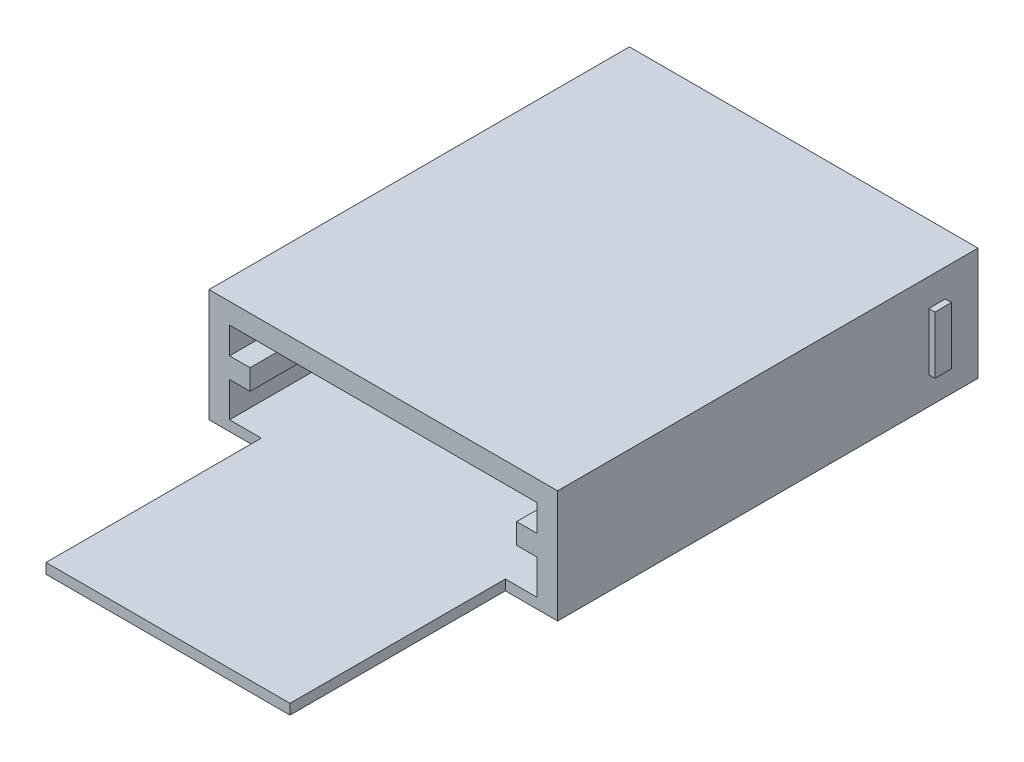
ISO-10303-21;
HEADER;
FILE_DESCRIPTION(('STEP AP214'),'2;1');
FILE_NAME('part.step','',(''),(''),'','','');
FILE_SCHEMA(('AUTOMOTIVE_DESIGN { 1 0 10303 214 1 1 1 1 }'));
ENDSEC;
DATA;
#1=APPLICATION_CONTEXT('core data for automotive mechanical design processes');
#2=APPLICATION_PROTOCOL_DEFINITION('international standard','automotive_design',2000,#1);
#3=PRODUCT_CONTEXT('',#1,'mechanical');
#4=PRODUCT('Part','Part','',(#3));
#5=PRODUCT_RELATED_PRODUCT_CATEGORY('part','',(#4));
#6=PRODUCT_DEFINITION_FORMATION('','',#4);
#7=PRODUCT_DEFINITION_CONTEXT('part definition',#1,'design');
#8=PRODUCT_DEFINITION('design','',#6,#7);
#9=PRODUCT_DEFINITION_SHAPE('','',#8);
#10=(LENGTH_UNIT() NAMED_UNIT(*) SI_UNIT(.MILLI.,.METRE.));
#11=(NAMED_UNIT(*) PLANE_ANGLE_UNIT() SI_UNIT($,.RADIAN.));
#12=(NAMED_UNIT(*) SI_UNIT($,.STERADIAN.) SOLID_ANGLE_UNIT());
#13=UNCERTAINTY_MEASURE_WITH_UNIT(LENGTH_MEASURE(1.E-05),#10,'distance_accuracy_value','');
#14=(GEOMETRIC_REPRESENTATION_CONTEXT(3) GLOBAL_UNCERTAINTY_ASSIGNED_CONTEXT((#13)) GLOBAL_UNIT_ASSIGNED_CONTEXT((#10,
#11,#12)) REPRESENTATION_CONTEXT('',''));
#15=CARTESIAN_POINT('',(0.,0.,0.));
#16=DIRECTION('',(0.,0.,1.));
#17=DIRECTION('',(1.,0.,0.));
#18=AXIS2_PLACEMENT_3D('',#15,#16,#17);
#19=CARTESIAN_POINT('',(7.5,0.,-15.));
#20=DIRECTION('',(-1.,0.,0.));
#21=DIRECTION('',(0.,0.,1.));
#22=AXIS2_PLACEMENT_3D('',#19,#20,#21);
#23=PLANE('',#22);
#24=DIRECTION('',(0.,0.,1.));
#25=VECTOR('',#24,1.);
#26=CARTESIAN_POINT('',(7.5,2.2,-16.));
#27=LINE('',#26,#25);
#28=CARTESIAN_POINT('',(7.5,2.2,-16.));
#29=VERTEX_POINT('',#28);
#30=CARTESIAN_POINT('',(7.5,2.2,4.5));
#31=VERTEX_POINT('',#30);
#32=EDGE_CURVE('E252',#29,#31,#27,.T.);
#33=ORIENTED_EDGE('',*,*,#32,.F.);
#34=DIRECTION('',(0.,-1.,0.));
#35=VECTOR('',#34,1.);
#36=CARTESIAN_POINT('',(7.5,4.5,-16.));
#37=LINE('',#36,#35);
#38=CARTESIAN_POINT('',(7.5,0.5,-16.));
#39=VERTEX_POINT('',#38);
#40=EDGE_CURVE('E341',#29,#39,#37,.T.);
#41=ORIENTED_EDGE('',*,*,#40,.T.);
#42=DIRECTION('',(0.,0.,-1.));
#43=VECTOR('',#42,1.);
#44=CARTESIAN_POINT('',(7.5,0.5,4.5));
#45=LINE('',#44,#43);
#46=CARTESIAN_POINT('',(7.5,0.5,4.5));
#47=VERTEX_POINT('',#46);
#48=EDGE_CURVE('E398',#47,#39,#45,.T.);
#49=ORIENTED_EDGE('',*,*,#48,.F.);
#50=DIRECTION('',(0.,1.,0.));
#51=VECTOR('',#50,1.);
#52=CARTESIAN_POINT('',(7.5,0.,4.5));
#53=LINE('',#52,#51);
#54=EDGE_CURVE('E56',#47,#31,#53,.T.);
#55=ORIENTED_EDGE('',*,*,#54,.T.);
#56=EDGE_LOOP('',(#33,#41,#49,#55));
#57=FACE_BOUND('',#56,.T.);
#58=ADVANCED_FACE('F33',(#57),#23,.T.);
#59=CARTESIAN_POINT('',(-7.5,0.,4.5));
#60=DIRECTION('',(1.,0.,0.));
#61=DIRECTION('',(0.,0.,-1.));
#62=AXIS2_PLACEMENT_3D('',#59,#60,#61);
#63=PLANE('',#62);
#64=DIRECTION('',(0.,0.,1.));
#65=VECTOR('',#64,1.);
#66=CARTESIAN_POINT('',(-7.5,3.2,-16.));
#67=LINE('',#66,#65);
#68=CARTESIAN_POINT('',(-7.5,3.2,-16.));
#69=VERTEX_POINT('',#68);
#70=CARTESIAN_POINT('',(-7.5,3.2,4.5));
#71=VERTEX_POINT('',#70);
#72=EDGE_CURVE('E275',#69,#71,#67,.T.);
#73=ORIENTED_EDGE('',*,*,#72,.F.);
#74=DIRECTION('',(0.,1.,0.));
#75=VECTOR('',#74,1.);
#76=CARTESIAN_POINT('',(-7.5,4.5,-16.));
#77=LINE('',#76,#75);
#78=CARTESIAN_POINT('',(-7.5,4.5,-16.));
#79=VERTEX_POINT('',#78);
#80=EDGE_CURVE('E347',#69,#79,#77,.T.);
#81=ORIENTED_EDGE('',*,*,#80,.T.);
#82=DIRECTION('',(0.,0.,-1.));
#83=VECTOR('',#82,1.);
#84=CARTESIAN_POINT('',(-7.5,4.5,4.5));
#85=LINE('',#84,#83);
#86=CARTESIAN_POINT('',(-7.5,4.5,4.5));
#87=VERTEX_POINT('',#86);
#88=EDGE_CURVE('E356',#87,#79,#85,.T.);
#89=ORIENTED_EDGE('',*,*,#88,.F.);
#90=DIRECTION('',(0.,1.,0.));
#91=VECTOR('',#90,1.);
#92=CARTESIAN_POINT('',(-7.5,0.,4.5));
#93=LINE('',#92,#91);
#94=EDGE_CURVE('E390',#71,#87,#93,.T.);
#95=ORIENTED_EDGE('',*,*,#94,.F.);
#96=EDGE_LOOP('',(#73,#81,#89,#95));
#97=FACE_BOUND('',#96,.T.);
#98=ADVANCED_FACE('F474',(#97),#63,.T.);
#99=CARTESIAN_POINT('',(-8.5,0.,-16.));
#100=DIRECTION('',(-1.,0.,0.));
#101=DIRECTION('',(0.,0.,1.));
#102=AXIS2_PLACEMENT_3D('',#99,#100,#101);
#103=PLANE('',#102);
#104=DIRECTION('',(0.,1.,0.));
#105=VECTOR('',#104,1.);
#106=CARTESIAN_POINT('',(-8.5,0.,4.5));
#107=LINE('',#106,#105);
#108=CARTESIAN_POINT('',(-8.5,0.,4.5));
#109=VERTEX_POINT('',#108);
#110=CARTESIAN_POINT('',(-8.5,5.5,4.5));
#111=VERTEX_POINT('',#110);
#112=EDGE_CURVE('E391',#109,#111,#107,.T.);
#113=ORIENTED_EDGE('',*,*,#112,.T.);
#114=DIRECTION('',(0.,0.,1.));
#115=VECTOR('',#114,1.);
#116=CARTESIAN_POINT('',(-8.5,5.5,-16.));
#117=LINE('',#116,#115);
#118=CARTESIAN_POINT('',(-8.5,5.5,-16.));
#119=VERTEX_POINT('',#118);
#120=EDGE_CURVE('E368',#119,#111,#117,.T.);
#121=ORIENTED_EDGE('',*,*,#120,.F.);
#122=DIRECTION('',(0.,1.,0.));
#123=VECTOR('',#122,1.);
#124=CARTESIAN_POINT('',(-8.5,0.,-16.));
#125=LINE('',#124,#123);
#126=CARTESIAN_POINT('',(-8.5,0.,-16.));
#127=VERTEX_POINT('',#126);
#128=EDGE_CURVE('E393',#127,#119,#125,.T.);
#129=ORIENTED_EDGE('',*,*,#128,.F.);
#130=DIRECTION('',(0.,0.,1.));
#131=VECTOR('',#130,1.);
#132=CARTESIAN_POINT('',(-8.5,0.,-16.));
#133=LINE('',#132,#131);
#134=EDGE_CURVE('E380',#127,#109,#133,.T.);
#135=ORIENTED_EDGE('',*,*,#134,.T.);
#136=EDGE_LOOP('',(#113,#121,#129,#135));
#137=FACE_BOUND('',#136,.T.);
#138=DIRECTION('',(0.,0.,1.));
#139=VECTOR('',#138,1.);
#140=CARTESIAN_POINT('',(-8.5,1.35,-14.4));
#141=LINE('',#140,#139);
#142=CARTESIAN_POINT('',(-8.5,1.35,-14.4));
#143=VERTEX_POINT('',#142);
#144=CARTESIAN_POINT('',(-8.5,1.35,-13.6));
#145=VERTEX_POINT('',#144);
#146=EDGE_CURVE('E297',#143,#145,#141,.T.);
#147=ORIENTED_EDGE('',*,*,#146,.F.);
#148=DIRECTION('',(0.,-1.,0.));
#149=VECTOR('',#148,1.);
#150=CARTESIAN_POINT('',(-8.5,4.15,-14.4));
#151=LINE('',#150,#149);
#152=CARTESIAN_POINT('',(-8.5,4.15,-14.4));
#153=VERTEX_POINT('',#152);
#154=EDGE_CURVE('E278',#153,#143,#151,.T.);
#155=ORIENTED_EDGE('',*,*,#154,.F.);
#156=DIRECTION('',(0.,0.,-1.));
#157=VECTOR('',#156,1.);
#158=CARTESIAN_POINT('',(-8.5,4.15,-14.4));
#159=LINE('',#158,#157);
#160=CARTESIAN_POINT('',(-8.5,4.15,-13.6));
#161=VERTEX_POINT('',#160);
#162=EDGE_CURVE('E288',#161,#153,#159,.T.);
#163=ORIENTED_EDGE('',*,*,#162,.F.);
#164=DIRECTION('',(0.,1.,0.));
#165=VECTOR('',#164,1.);
#166=CARTESIAN_POINT('',(-8.5,4.15,-13.6));
#167=LINE('',#166,#165);
#168=EDGE_CURVE('E299',#145,#161,#167,.T.);
#169=ORIENTED_EDGE('',*,*,#168,.F.);
#170=EDGE_LOOP('',(#147,#155,#163,#169));
#171=FACE_BOUND('',#170,.T.);
#172=ADVANCED_FACE('F498',(#137,#171),#103,.T.);
#173=CARTESIAN_POINT('',(8.5,0.,4.5));
#174=DIRECTION('',(1.,0.,0.));
#175=DIRECTION('',(0.,0.,-1.));
#176=AXIS2_PLACEMENT_3D('',#173,#174,#175);
#177=PLANE('',#176);
#178=DIRECTION('',(0.,1.,0.));
#179=VECTOR('',#178,1.);
#180=CARTESIAN_POINT('',(8.49999999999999,0.,-16.));
#181=LINE('',#180,#179);
#182=CARTESIAN_POINT('',(8.49999999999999,0.,-16.));
#183=VERTEX_POINT('',#182);
#184=CARTESIAN_POINT('',(8.49999999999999,5.5,-16.));
#185=VERTEX_POINT('',#184);
#186=EDGE_CURVE('E395',#183,#185,#181,.T.);
#187=ORIENTED_EDGE('',*,*,#186,.T.);
#188=DIRECTION('',(0.,0.,-1.));
#189=VECTOR('',#188,1.);
#190=CARTESIAN_POINT('',(8.5,5.5,4.5));
#191=LINE('',#190,#189);
#192=CARTESIAN_POINT('',(8.5,5.5,4.5));
#193=VERTEX_POINT('',#192);
#194=EDGE_CURVE('E362',#193,#185,#191,.T.);
#195=ORIENTED_EDGE('',*,*,#194,.F.);
#196=DIRECTION('',(0.,1.,0.));
#197=VECTOR('',#196,1.);
#198=CARTESIAN_POINT('',(8.5,0.,4.5));
#199=LINE('',#198,#197);
#200=CARTESIAN_POINT('',(8.5,0.,4.5));
#201=VERTEX_POINT('',#200);
#202=EDGE_CURVE('E383',#201,#193,#199,.T.);
#203=ORIENTED_EDGE('',*,*,#202,.F.);
#204=DIRECTION('',(0.,0.,-1.));
#205=VECTOR('',#204,1.);
#206=CARTESIAN_POINT('',(8.5,0.,4.5));
#207=LINE('',#206,#205);
#208=EDGE_CURVE('E374',#201,#183,#207,.T.);
#209=ORIENTED_EDGE('',*,*,#208,.T.);
#210=EDGE_LOOP('',(#187,#195,#203,#209));
#211=FACE_BOUND('',#210,.T.);
#212=DIRECTION('',(0.,0.,-1.));
#213=VECTOR('',#212,1.);
#214=CARTESIAN_POINT('',(8.49999999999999,1.35,-13.6));
#215=LINE('',#214,#213);
#216=CARTESIAN_POINT('',(8.49999999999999,1.35,-13.6));
#217=VERTEX_POINT('',#216);
#218=CARTESIAN_POINT('',(8.49999999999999,1.35,-14.4));
#219=VERTEX_POINT('',#218);
#220=EDGE_CURVE('E326',#217,#219,#215,.T.);
#221=ORIENTED_EDGE('',*,*,#220,.F.);
#222=DIRECTION('',(0.,-1.,0.));
#223=VECTOR('',#222,1.);
#224=CARTESIAN_POINT('',(8.49999999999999,4.15,-13.6));
#225=LINE('',#224,#223);
#226=CARTESIAN_POINT('',(8.49999999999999,4.15,-13.6));
#227=VERTEX_POINT('',#226);
#228=EDGE_CURVE('E312',#227,#217,#225,.T.);
#229=ORIENTED_EDGE('',*,*,#228,.F.);
#230=DIRECTION('',(0.,0.,1.));
#231=VECTOR('',#230,1.);
#232=CARTESIAN_POINT('',(8.49999999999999,4.15,-13.6));
#233=LINE('',#232,#231);
#234=CARTESIAN_POINT('',(8.49999999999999,4.15,-14.4));
#235=VERTEX_POINT('',#234);
#236=EDGE_CURVE('E317',#235,#227,#233,.T.);
#237=ORIENTED_EDGE('',*,*,#236,.F.);
#238=DIRECTION('',(0.,1.,0.));
#239=VECTOR('',#238,1.);
#240=CARTESIAN_POINT('',(8.49999999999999,4.15,-14.4));
#241=LINE('',#240,#239);
#242=EDGE_CURVE('E328',#219,#235,#241,.T.);
#243=ORIENTED_EDGE('',*,*,#242,.F.);
#244=EDGE_LOOP('',(#221,#229,#237,#243));
#245=FACE_BOUND('',#244,.T.);
#246=ADVANCED_FACE('F521',(#211,#245),#177,.T.);
#247=CARTESIAN_POINT('',(-5.95,0.5,15.));
#248=DIRECTION('',(1.,0.,0.));
#249=DIRECTION('',(0.,0.,-1.));
#250=AXIS2_PLACEMENT_3D('',#247,#248,#249);
#251=PLANE('',#250);
#252=DIRECTION('',(0.,0.,1.));
#253=VECTOR('',#252,1.);
#254=CARTESIAN_POINT('',(-5.95,0.,15.));
#255=LINE('',#254,#253);
#256=CARTESIAN_POINT('',(-5.95,0.,4.5));
#257=VERTEX_POINT('',#256);
#258=CARTESIAN_POINT('',(-5.95,0.,15.));
#259=VERTEX_POINT('',#258);
#260=EDGE_CURVE('E416',#257,#259,#255,.T.);
#261=ORIENTED_EDGE('',*,*,#260,.T.);
#262=DIRECTION('',(0.,-1.,0.));
#263=VECTOR('',#262,1.);
#264=CARTESIAN_POINT('',(-5.95,0.5,15.));
#265=LINE('',#264,#263);
#266=CARTESIAN_POINT('',(-5.95,0.5,15.));
#267=VERTEX_POINT('',#266);
#268=EDGE_CURVE('E41',#267,#259,#265,.T.);
#269=ORIENTED_EDGE('',*,*,#268,.F.);
#270=DIRECTION('',(0.,0.,1.));
#271=VECTOR('',#270,1.);
#272=CARTESIAN_POINT('',(-5.95,0.5,15.));
#273=LINE('',#272,#271);
#274=CARTESIAN_POINT('',(-5.95,0.5,4.5));
#275=VERTEX_POINT('',#274);
#276=EDGE_CURVE('E406',#275,#267,#273,.T.);
#277=ORIENTED_EDGE('',*,*,#276,.F.);
#278=DIRECTION('',(0.,-1.,0.));
#279=VECTOR('',#278,1.);
#280=CARTESIAN_POINT('',(-5.95,0.5,4.5));
#281=LINE('',#280,#279);
#282=EDGE_CURVE('E11',#275,#257,#281,.T.);
#283=ORIENTED_EDGE('',*,*,#282,.T.);
#284=EDGE_LOOP('',(#261,#269,#277,#283));
#285=FACE_BOUND('',#284,.T.);
#286=ADVANCED_FACE('F35',(#285),#251,.F.);
#287=CARTESIAN_POINT('',(-5.95,0.5,15.));
#288=DIRECTION('',(0.,0.,-1.));
#289=DIRECTION('',(-1.,0.,0.));
#290=AXIS2_PLACEMENT_3D('',#287,#288,#289);
#291=PLANE('',#290);
#292=DIRECTION('',(1.,0.,0.));
#293=VECTOR('',#292,1.);
#294=CARTESIAN_POINT('',(-5.95,0.,15.));
#295=LINE('',#294,#293);
#296=CARTESIAN_POINT('',(5.95,0.,15.));
#297=VERTEX_POINT('',#296);
#298=EDGE_CURVE('E418',#259,#297,#295,.T.);
#299=ORIENTED_EDGE('',*,*,#298,.T.);
#300=DIRECTION('',(0.,-1.,0.));
#301=VECTOR('',#300,1.);
#302=CARTESIAN_POINT('',(5.95,0.5,15.));
#303=LINE('',#302,#301);
#304=CARTESIAN_POINT('',(5.95,0.5,15.));
#305=VERTEX_POINT('',#304);
#306=EDGE_CURVE('E425',#305,#297,#303,.T.);
#307=ORIENTED_EDGE('',*,*,#306,.F.);
#308=DIRECTION('',(1.,0.,0.));
#309=VECTOR('',#308,1.);
#310=CARTESIAN_POINT('',(-5.95,0.5,15.));
#311=LINE('',#310,#309);
#312=EDGE_CURVE('E408',#267,#305,#311,.T.);
#313=ORIENTED_EDGE('',*,*,#312,.F.);
#314=ORIENTED_EDGE('',*,*,#268,.T.);
#315=EDGE_LOOP('',(#299,#307,#313,#314));
#316=FACE_BOUND('',#315,.T.);
#317=ADVANCED_FACE('F432',(#316),#291,.F.);
#318=CARTESIAN_POINT('',(5.95,0.5,15.));
#319=DIRECTION('',(-1.,0.,0.));
#320=DIRECTION('',(0.,0.,1.));
#321=AXIS2_PLACEMENT_3D('',#318,#319,#320);
#322=PLANE('',#321);
#323=DIRECTION('',(0.,0.,-1.));
#324=VECTOR('',#323,1.);
#325=CARTESIAN_POINT('',(5.95,0.,15.));
#326=LINE('',#325,#324);
#327=CARTESIAN_POINT('',(5.95,0.,4.5));
#328=VERTEX_POINT('',#327);
#329=EDGE_CURVE('E420',#297,#328,#326,.T.);
#330=ORIENTED_EDGE('',*,*,#329,.T.);
#331=DIRECTION('',(0.,-1.,0.));
#332=VECTOR('',#331,1.);
#333=CARTESIAN_POINT('',(5.95,0.5,4.5));
#334=LINE('',#333,#332);
#335=CARTESIAN_POINT('',(5.95,0.5,4.5));
#336=VERTEX_POINT('',#335);
#337=EDGE_CURVE('E414',#336,#328,#334,.T.);
#338=ORIENTED_EDGE('',*,*,#337,.F.);
#339=DIRECTION('',(0.,0.,-1.));
#340=VECTOR('',#339,1.);
#341=CARTESIAN_POINT('',(5.95,0.5,15.));
#342=LINE('',#341,#340);
#343=EDGE_CURVE('E410',#305,#336,#342,.T.);
#344=ORIENTED_EDGE('',*,*,#343,.F.);
#345=ORIENTED_EDGE('',*,*,#306,.T.);
#346=EDGE_LOOP('',(#330,#338,#344,#345));
#347=FACE_BOUND('',#346,.T.);
#348=ADVANCED_FACE('F444',(#347),#322,.F.);
#349=CARTESIAN_POINT('',(5.95,0.5,4.5));
#350=DIRECTION('',(0.,0.,-1.));
#351=DIRECTION('',(-1.,0.,0.));
#352=AXIS2_PLACEMENT_3D('',#349,#350,#351);
#353=PLANE('',#352);
#354=ORIENTED_EDGE('',*,*,#202,.T.);
#355=DIRECTION('',(-1.,0.,0.));
#356=VECTOR('',#355,1.);
#357=CARTESIAN_POINT('',(-7.5,5.5,4.5));
#358=LINE('',#357,#356);
#359=EDGE_CURVE('E371',#193,#111,#358,.T.);
#360=ORIENTED_EDGE('',*,*,#359,.T.);
#361=ORIENTED_EDGE('',*,*,#112,.F.);
#362=DIRECTION('',(1.,0.,0.));
#363=VECTOR('',#362,1.);
#364=CARTESIAN_POINT('',(-5.95,0.,4.5));
#365=LINE('',#364,#363);
#366=EDGE_CURVE('E385',#109,#257,#365,.T.);
#367=ORIENTED_EDGE('',*,*,#366,.T.);
#368=ORIENTED_EDGE('',*,*,#282,.F.);
#369=DIRECTION('',(1.,0.,0.));
#370=VECTOR('',#369,1.);
#371=CARTESIAN_POINT('',(-5.95,0.5,4.5));
#372=LINE('',#371,#370);
#373=CARTESIAN_POINT('',(-7.5,0.5,4.5));
#374=VERTEX_POINT('',#373);
#375=EDGE_CURVE('E404',#374,#275,#372,.T.);
#376=ORIENTED_EDGE('',*,*,#375,.F.);
#377=CARTESIAN_POINT('',(-7.5,2.2,4.5));
#378=VERTEX_POINT('',#377);
#379=EDGE_CURVE('E387',#374,#378,#93,.T.);
#380=ORIENTED_EDGE('',*,*,#379,.T.);
#381=DIRECTION('',(1.,0.,0.));
#382=VECTOR('',#381,1.);
#383=CARTESIAN_POINT('',(-7.5,2.2,4.5));
#384=LINE('',#383,#382);
#385=CARTESIAN_POINT('',(-6.50000000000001,2.2,4.5));
#386=VERTEX_POINT('',#385);
#387=EDGE_CURVE('E254',#378,#386,#384,.T.);
#388=ORIENTED_EDGE('',*,*,#387,.T.);
#389=DIRECTION('',(0.,1.,0.));
#390=VECTOR('',#389,1.);
#391=CARTESIAN_POINT('',(-6.50000000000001,3.2,4.5));
#392=LINE('',#391,#390);
#393=CARTESIAN_POINT('',(-6.50000000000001,3.2,4.5));
#394=VERTEX_POINT('',#393);
#395=EDGE_CURVE('E270',#386,#394,#392,.T.);
#396=ORIENTED_EDGE('',*,*,#395,.T.);
#397=DIRECTION('',(-1.,0.,0.));
#398=VECTOR('',#397,1.);
#399=CARTESIAN_POINT('',(-7.5,3.2,4.5));
#400=LINE('',#399,#398);
#401=EDGE_CURVE('E261',#394,#71,#400,.T.);
#402=ORIENTED_EDGE('',*,*,#401,.T.);
#403=ORIENTED_EDGE('',*,*,#94,.T.);
#404=DIRECTION('',(1.,0.,0.));
#405=VECTOR('',#404,1.);
#406=CARTESIAN_POINT('',(8.49999999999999,4.5,4.5));
#407=LINE('',#406,#405);
#408=CARTESIAN_POINT('',(7.5,4.5,4.5));
#409=VERTEX_POINT('',#408);
#410=EDGE_CURVE('E353',#87,#409,#407,.T.);
#411=ORIENTED_EDGE('',*,*,#410,.T.);
#412=CARTESIAN_POINT('',(7.5,3.2,4.5));
#413=VERTEX_POINT('',#412);
#414=EDGE_CURVE('E386',#413,#409,#53,.T.);
#415=ORIENTED_EDGE('',*,*,#414,.F.);
#416=DIRECTION('',(-1.,0.,0.));
#417=VECTOR('',#416,1.);
#418=CARTESIAN_POINT('',(7.5,3.2,4.5));
#419=LINE('',#418,#417);
#420=CARTESIAN_POINT('',(6.49999999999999,3.2,4.5));
#421=VERTEX_POINT('',#420);
#422=EDGE_CURVE('E249',#413,#421,#419,.T.);
#423=ORIENTED_EDGE('',*,*,#422,.T.);
#424=DIRECTION('',(0.,-1.,0.));
#425=VECTOR('',#424,1.);
#426=CARTESIAN_POINT('',(6.49999999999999,3.2,4.5));
#427=LINE('',#426,#425);
#428=CARTESIAN_POINT('',(6.49999999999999,2.2,4.5));
#429=VERTEX_POINT('',#428);
#430=EDGE_CURVE('E226',#421,#429,#427,.T.);
#431=ORIENTED_EDGE('',*,*,#430,.T.);
#432=DIRECTION('',(1.,0.,0.));
#433=VECTOR('',#432,1.);
#434=CARTESIAN_POINT('',(7.5,2.2,4.5));
#435=LINE('',#434,#433);
#436=EDGE_CURVE('E243',#429,#31,#435,.T.);
#437=ORIENTED_EDGE('',*,*,#436,.T.);
#438=ORIENTED_EDGE('',*,*,#54,.F.);
#439=DIRECTION('',(1.,0.,0.));
#440=VECTOR('',#439,1.);
#441=CARTESIAN_POINT('',(5.95,0.5,4.5));
#442=LINE('',#441,#440);
#443=EDGE_CURVE('E412',#336,#47,#442,.T.);
#444=ORIENTED_EDGE('',*,*,#443,.F.);
#445=ORIENTED_EDGE('',*,*,#337,.T.);
#446=DIRECTION('',(1.,0.,0.));
#447=VECTOR('',#446,1.);
#448=CARTESIAN_POINT('',(5.95,0.,4.5));
#449=LINE('',#448,#447);
#450=EDGE_CURVE('E402',#328,#201,#449,.T.);
#451=ORIENTED_EDGE('',*,*,#450,.T.);
#452=EDGE_LOOP('',(#354,#360,#361,#367,#368,#376,#380,#388,#396,#402,#403,#411,#415,#423,#431,
#437,#438,#444,#445,#451));
#453=FACE_BOUND('',#452,.T.);
#454=ADVANCED_FACE('F448',(#453),#353,.F.);
#455=CARTESIAN_POINT('',(0.,0.5,0.));
#456=DIRECTION('',(0.,-1.,0.));
#457=DIRECTION('',(0.,0.,-1.));
#458=AXIS2_PLACEMENT_3D('',#455,#456,#457);
#459=PLANE('',#458);
#460=ORIENTED_EDGE('',*,*,#48,.T.);
#461=DIRECTION('',(-1.,0.,0.));
#462=VECTOR('',#461,1.);
#463=CARTESIAN_POINT('',(7.5,0.5,-16.));
#464=LINE('',#463,#462);
#465=CARTESIAN_POINT('',(-7.5,0.5,-16.));
#466=VERTEX_POINT('',#465);
#467=EDGE_CURVE('E344',#39,#466,#464,.T.);
#468=ORIENTED_EDGE('',*,*,#467,.T.);
#469=DIRECTION('',(0.,0.,1.));
#470=VECTOR('',#469,1.);
#471=CARTESIAN_POINT('',(-7.5,0.5,4.5));
#472=LINE('',#471,#470);
#473=EDGE_CURVE('E401',#466,#374,#472,.T.);
#474=ORIENTED_EDGE('',*,*,#473,.T.);
#475=ORIENTED_EDGE('',*,*,#375,.T.);
#476=ORIENTED_EDGE('',*,*,#276,.T.);
#477=ORIENTED_EDGE('',*,*,#312,.T.);
#478=ORIENTED_EDGE('',*,*,#343,.T.);
#479=ORIENTED_EDGE('',*,*,#443,.T.);
#480=EDGE_LOOP('',(#460,#468,#474,#475,#476,#477,#478,#479));
#481=FACE_BOUND('',#480,.T.);
#482=ADVANCED_FACE('F451',(#481),#459,.F.);
#483=CARTESIAN_POINT('',(0.,0.,0.));
#484=DIRECTION('',(0.,-1.,0.));
#485=DIRECTION('',(0.,0.,-1.));
#486=AXIS2_PLACEMENT_3D('',#483,#484,#485);
#487=PLANE('',#486);
#488=ORIENTED_EDGE('',*,*,#208,.F.);
#489=ORIENTED_EDGE('',*,*,#450,.F.);
#490=ORIENTED_EDGE('',*,*,#329,.F.);
#491=ORIENTED_EDGE('',*,*,#298,.F.);
#492=ORIENTED_EDGE('',*,*,#260,.F.);
#493=ORIENTED_EDGE('',*,*,#366,.F.);
#494=ORIENTED_EDGE('',*,*,#134,.F.);
#495=DIRECTION('',(-1.,0.,0.));
#496=VECTOR('',#495,1.);
#497=CARTESIAN_POINT('',(8.49999999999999,0.,-16.));
#498=LINE('',#497,#496);
#499=EDGE_CURVE('E377',#183,#127,#498,.T.);
#500=ORIENTED_EDGE('',*,*,#499,.F.);
#501=EDGE_LOOP('',(#488,#489,#490,#491,#492,#493,#494,#500));
#502=FACE_BOUND('',#501,.T.);
#503=ADVANCED_FACE('F440',(#502),#487,.T.);
#504=DIRECTION('',(0.,0.,1.));
#505=VECTOR('',#504,1.);
#506=CARTESIAN_POINT('',(7.5,3.2,-16.));
#507=LINE('',#506,#505);
#508=CARTESIAN_POINT('',(7.5,3.2,-16.));
#509=VERTEX_POINT('',#508);
#510=EDGE_CURVE('E48',#509,#413,#507,.T.);
#511=ORIENTED_EDGE('',*,*,#510,.T.);
#512=ORIENTED_EDGE('',*,*,#414,.T.);
#513=DIRECTION('',(0.,0.,1.));
#514=VECTOR('',#513,1.);
#515=CARTESIAN_POINT('',(7.5,4.5,-15.));
#516=LINE('',#515,#514);
#517=CARTESIAN_POINT('',(7.5,4.5,-16.));
#518=VERTEX_POINT('',#517);
#519=EDGE_CURVE('E359',#518,#409,#516,.T.);
#520=ORIENTED_EDGE('',*,*,#519,.F.);
#521=EDGE_CURVE('E342',#518,#509,#37,.T.);
#522=ORIENTED_EDGE('',*,*,#521,.T.);
#523=EDGE_LOOP('',(#511,#512,#520,#522));
#524=FACE_BOUND('',#523,.T.);
#525=ADVANCED_FACE('F480',(#524),#23,.T.);
#526=DIRECTION('',(0.,0.,1.));
#527=VECTOR('',#526,1.);
#528=CARTESIAN_POINT('',(-7.5,2.2,-16.));
#529=LINE('',#528,#527);
#530=CARTESIAN_POINT('',(-7.5,2.2,-16.));
#531=VERTEX_POINT('',#530);
#532=EDGE_CURVE('E267',#531,#378,#529,.T.);
#533=ORIENTED_EDGE('',*,*,#532,.T.);
#534=ORIENTED_EDGE('',*,*,#379,.F.);
#535=ORIENTED_EDGE('',*,*,#473,.F.);
#536=EDGE_CURVE('E348',#466,#531,#77,.T.);
#537=ORIENTED_EDGE('',*,*,#536,.T.);
#538=EDGE_LOOP('',(#533,#534,#535,#537));
#539=FACE_BOUND('',#538,.T.);
#540=ADVANCED_FACE('F460',(#539),#63,.T.);
#541=CARTESIAN_POINT('',(8.49999999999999,0.,-16.));
#542=DIRECTION('',(0.,0.,-1.));
#543=DIRECTION('',(-1.,0.,0.));
#544=AXIS2_PLACEMENT_3D('',#541,#542,#543);
#545=PLANE('',#544);
#546=ORIENTED_EDGE('',*,*,#521,.F.);
#547=DIRECTION('',(1.,0.,0.));
#548=VECTOR('',#547,1.);
#549=CARTESIAN_POINT('',(7.5,4.5,-16.));
#550=LINE('',#549,#548);
#551=EDGE_CURVE('E350',#79,#518,#550,.T.);
#552=ORIENTED_EDGE('',*,*,#551,.F.);
#553=ORIENTED_EDGE('',*,*,#80,.F.);
#554=DIRECTION('',(-1.,0.,0.));
#555=VECTOR('',#554,1.);
#556=CARTESIAN_POINT('',(-7.5,3.2,-16.));
#557=LINE('',#556,#555);
#558=CARTESIAN_POINT('',(-6.50000000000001,3.2,-16.));
#559=VERTEX_POINT('',#558);
#560=EDGE_CURVE('E264',#559,#69,#557,.T.);
#561=ORIENTED_EDGE('',*,*,#560,.F.);
#562=DIRECTION('',(0.,1.,0.));
#563=VECTOR('',#562,1.);
#564=CARTESIAN_POINT('',(-6.50000000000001,3.2,-16.));
#565=LINE('',#564,#563);
#566=CARTESIAN_POINT('',(-6.50000000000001,2.2,-16.));
#567=VERTEX_POINT('',#566);
#568=EDGE_CURVE('E260',#567,#559,#565,.T.);
#569=ORIENTED_EDGE('',*,*,#568,.F.);
#570=DIRECTION('',(1.,0.,0.));
#571=VECTOR('',#570,1.);
#572=CARTESIAN_POINT('',(-7.5,2.2,-16.));
#573=LINE('',#572,#571);
#574=EDGE_CURVE('E257',#531,#567,#573,.T.);
#575=ORIENTED_EDGE('',*,*,#574,.F.);
#576=ORIENTED_EDGE('',*,*,#536,.F.);
#577=ORIENTED_EDGE('',*,*,#467,.F.);
#578=ORIENTED_EDGE('',*,*,#40,.F.);
#579=DIRECTION('',(1.,0.,0.));
#580=VECTOR('',#579,1.);
#581=CARTESIAN_POINT('',(7.5,2.2,-16.));
#582=LINE('',#581,#580);
#583=CARTESIAN_POINT('',(6.49999999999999,2.2,-16.));
#584=VERTEX_POINT('',#583);
#585=EDGE_CURVE('E240',#584,#29,#582,.T.);
#586=ORIENTED_EDGE('',*,*,#585,.F.);
#587=DIRECTION('',(0.,-1.,0.));
#588=VECTOR('',#587,1.);
#589=CARTESIAN_POINT('',(6.49999999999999,3.2,-16.));
#590=LINE('',#589,#588);
#591=CARTESIAN_POINT('',(6.49999999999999,3.2,-16.));
#592=VERTEX_POINT('',#591);
#593=EDGE_CURVE('E223',#592,#584,#590,.T.);
#594=ORIENTED_EDGE('',*,*,#593,.F.);
#595=DIRECTION('',(-1.,0.,0.));
#596=VECTOR('',#595,1.);
#597=CARTESIAN_POINT('',(7.5,3.2,-16.));
#598=LINE('',#597,#596);
#599=EDGE_CURVE('E238',#509,#592,#598,.T.);
#600=ORIENTED_EDGE('',*,*,#599,.F.);
#601=EDGE_LOOP('',(#546,#552,#553,#561,#569,#575,#576,#577,#578,#586,#594,#600));
#602=FACE_BOUND('',#601,.T.);
#603=ORIENTED_EDGE('',*,*,#128,.T.);
#604=DIRECTION('',(-1.,0.,0.));
#605=VECTOR('',#604,1.);
#606=CARTESIAN_POINT('',(8.49999999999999,5.5,-16.));
#607=LINE('',#606,#605);
#608=EDGE_CURVE('E365',#185,#119,#607,.T.);
#609=ORIENTED_EDGE('',*,*,#608,.F.);
#610=ORIENTED_EDGE('',*,*,#186,.F.);
#611=ORIENTED_EDGE('',*,*,#499,.T.);
#612=EDGE_LOOP('',(#603,#609,#610,#611));
#613=FACE_BOUND('',#612,.T.);
#614=ADVANCED_FACE('F236',(#602,#613),#545,.T.);
#615=CARTESIAN_POINT('',(0.,5.5,0.));
#616=DIRECTION('',(0.,1.,0.));
#617=DIRECTION('',(0.,0.,1.));
#618=AXIS2_PLACEMENT_3D('',#615,#616,#617);
#619=PLANE('',#618);
#620=ORIENTED_EDGE('',*,*,#359,.F.);
#621=ORIENTED_EDGE('',*,*,#194,.T.);
#622=ORIENTED_EDGE('',*,*,#608,.T.);
#623=ORIENTED_EDGE('',*,*,#120,.T.);
#624=EDGE_LOOP('',(#620,#621,#622,#623));
#625=FACE_BOUND('',#624,.T.);
#626=ADVANCED_FACE('F536',(#625),#619,.T.);
#627=CARTESIAN_POINT('',(0.,4.5,0.));
#628=DIRECTION('',(0.,-1.,0.));
#629=DIRECTION('',(0.,0.,-1.));
#630=AXIS2_PLACEMENT_3D('',#627,#628,#629);
#631=PLANE('',#630);
#632=ORIENTED_EDGE('',*,*,#88,.T.);
#633=ORIENTED_EDGE('',*,*,#551,.T.);
#634=ORIENTED_EDGE('',*,*,#519,.T.);
#635=ORIENTED_EDGE('',*,*,#410,.F.);
#636=EDGE_LOOP('',(#632,#633,#634,#635));
#637=FACE_BOUND('',#636,.T.);
#638=ADVANCED_FACE('F478',(#637),#631,.T.);
#639=CARTESIAN_POINT('',(8.8,4.15,-13.6));
#640=DIRECTION('',(0.,0.,-1.));
#641=DIRECTION('',(-1.,0.,0.));
#642=AXIS2_PLACEMENT_3D('',#639,#640,#641);
#643=PLANE('',#642);
#644=ORIENTED_EDGE('',*,*,#228,.T.);
#645=DIRECTION('',(-1.,0.,0.));
#646=VECTOR('',#645,1.);
#647=CARTESIAN_POINT('',(8.8,1.35,-13.6));
#648=LINE('',#647,#646);
#649=CARTESIAN_POINT('',(8.8,1.35,-13.6));
#650=VERTEX_POINT('',#649);
#651=EDGE_CURVE('E339',#650,#217,#648,.T.);
#652=ORIENTED_EDGE('',*,*,#651,.F.);
#653=DIRECTION('',(0.,-1.,0.));
#654=VECTOR('',#653,1.);
#655=CARTESIAN_POINT('',(8.8,4.15,-13.6));
#656=LINE('',#655,#654);
#657=CARTESIAN_POINT('',(8.8,4.15,-13.6));
#658=VERTEX_POINT('',#657);
#659=EDGE_CURVE('E313',#658,#650,#656,.T.);
#660=ORIENTED_EDGE('',*,*,#659,.F.);
#661=DIRECTION('',(-1.,0.,0.));
#662=VECTOR('',#661,1.);
#663=CARTESIAN_POINT('',(8.8,4.15,-13.6));
#664=LINE('',#663,#662);
#665=EDGE_CURVE('E323',#658,#227,#664,.T.);
#666=ORIENTED_EDGE('',*,*,#665,.T.);
#667=EDGE_LOOP('',(#644,#652,#660,#666));
#668=FACE_BOUND('',#667,.T.);
#669=ADVANCED_FACE('F546',(#668),#643,.F.);
#670=CARTESIAN_POINT('',(8.8,1.35,-13.6));
#671=DIRECTION('',(0.,1.,0.));
#672=DIRECTION('',(0.,0.,1.));
#673=AXIS2_PLACEMENT_3D('',#670,#671,#672);
#674=PLANE('',#673);
#675=ORIENTED_EDGE('',*,*,#220,.T.);
#676=DIRECTION('',(-1.,0.,0.));
#677=VECTOR('',#676,1.);
#678=CARTESIAN_POINT('',(8.8,1.35,-14.4));
#679=LINE('',#678,#677);
#680=CARTESIAN_POINT('',(8.8,1.35,-14.4));
#681=VERTEX_POINT('',#680);
#682=EDGE_CURVE('E336',#681,#219,#679,.T.);
#683=ORIENTED_EDGE('',*,*,#682,.F.);
#684=DIRECTION('',(0.,0.,-1.));
#685=VECTOR('',#684,1.);
#686=CARTESIAN_POINT('',(8.8,1.35,-13.6));
#687=LINE('',#686,#685);
#688=EDGE_CURVE('E316',#650,#681,#687,.T.);
#689=ORIENTED_EDGE('',*,*,#688,.F.);
#690=ORIENTED_EDGE('',*,*,#651,.T.);
#691=EDGE_LOOP('',(#675,#683,#689,#690));
#692=FACE_BOUND('',#691,.T.);
#693=ADVANCED_FACE('F551',(#692),#674,.F.);
#694=CARTESIAN_POINT('',(8.8,4.15,-14.4));
#695=DIRECTION('',(0.,0.,1.));
#696=DIRECTION('',(1.,0.,0.));
#697=AXIS2_PLACEMENT_3D('',#694,#695,#696);
#698=PLANE('',#697);
#699=ORIENTED_EDGE('',*,*,#242,.T.);
#700=DIRECTION('',(-1.,0.,0.));
#701=VECTOR('',#700,1.);
#702=CARTESIAN_POINT('',(8.8,4.15,-14.4));
#703=LINE('',#702,#701);
#704=CARTESIAN_POINT('',(8.8,4.15,-14.4));
#705=VERTEX_POINT('',#704);
#706=EDGE_CURVE('E334',#705,#235,#703,.T.);
#707=ORIENTED_EDGE('',*,*,#706,.F.);
#708=DIRECTION('',(0.,1.,0.));
#709=VECTOR('',#708,1.);
#710=CARTESIAN_POINT('',(8.8,4.15,-14.4));
#711=LINE('',#710,#709);
#712=EDGE_CURVE('E319',#681,#705,#711,.T.);
#713=ORIENTED_EDGE('',*,*,#712,.F.);
#714=ORIENTED_EDGE('',*,*,#682,.T.);
#715=EDGE_LOOP('',(#699,#707,#713,#714));
#716=FACE_BOUND('',#715,.T.);
#717=ADVANCED_FACE('F555',(#716),#698,.F.);
#718=CARTESIAN_POINT('',(8.8,4.15,-13.6));
#719=DIRECTION('',(0.,-1.,0.));
#720=DIRECTION('',(0.,0.,-1.));
#721=AXIS2_PLACEMENT_3D('',#718,#719,#720);
#722=PLANE('',#721);
#723=ORIENTED_EDGE('',*,*,#236,.T.);
#724=ORIENTED_EDGE('',*,*,#665,.F.);
#725=DIRECTION('',(0.,0.,1.));
#726=VECTOR('',#725,1.);
#727=CARTESIAN_POINT('',(8.8,4.15,-13.6));
#728=LINE('',#727,#726);
#729=EDGE_CURVE('E321',#705,#658,#728,.T.);
#730=ORIENTED_EDGE('',*,*,#729,.F.);
#731=ORIENTED_EDGE('',*,*,#706,.T.);
#732=EDGE_LOOP('',(#723,#724,#730,#731));
#733=FACE_BOUND('',#732,.T.);
#734=ADVANCED_FACE('F559',(#733),#722,.F.);
#735=CARTESIAN_POINT('',(8.8,0.,0.));
#736=DIRECTION('',(1.,0.,0.));
#737=DIRECTION('',(0.,0.,-1.));
#738=AXIS2_PLACEMENT_3D('',#735,#736,#737);
#739=PLANE('',#738);
#740=ORIENTED_EDGE('',*,*,#659,.T.);
#741=ORIENTED_EDGE('',*,*,#688,.T.);
#742=ORIENTED_EDGE('',*,*,#712,.T.);
#743=ORIENTED_EDGE('',*,*,#729,.T.);
#744=EDGE_LOOP('',(#740,#741,#742,#743));
#745=FACE_BOUND('',#744,.T.);
#746=ADVANCED_FACE('F563',(#745),#739,.T.);
#747=CARTESIAN_POINT('',(-8.8,4.15,-14.4));
#748=DIRECTION('',(0.,0.,1.));
#749=DIRECTION('',(1.,0.,0.));
#750=AXIS2_PLACEMENT_3D('',#747,#748,#749);
#751=PLANE('',#750);
#752=ORIENTED_EDGE('',*,*,#154,.T.);
#753=DIRECTION('',(1.,0.,0.));
#754=VECTOR('',#753,1.);
#755=CARTESIAN_POINT('',(-8.8,1.35,-14.4));
#756=LINE('',#755,#754);
#757=CARTESIAN_POINT('',(-8.8,1.35,-14.4));
#758=VERTEX_POINT('',#757);
#759=EDGE_CURVE('E310',#758,#143,#756,.T.);
#760=ORIENTED_EDGE('',*,*,#759,.F.);
#761=DIRECTION('',(0.,-1.,0.));
#762=VECTOR('',#761,1.);
#763=CARTESIAN_POINT('',(-8.8,4.15,-14.4));
#764=LINE('',#763,#762);
#765=CARTESIAN_POINT('',(-8.8,4.15,-14.4));
#766=VERTEX_POINT('',#765);
#767=EDGE_CURVE('E284',#766,#758,#764,.T.);
#768=ORIENTED_EDGE('',*,*,#767,.F.);
#769=DIRECTION('',(1.,0.,0.));
#770=VECTOR('',#769,1.);
#771=CARTESIAN_POINT('',(-8.8,4.15,-14.4));
#772=LINE('',#771,#770);
#773=EDGE_CURVE('E294',#766,#153,#772,.T.);
#774=ORIENTED_EDGE('',*,*,#773,.T.);
#775=EDGE_LOOP('',(#752,#760,#768,#774));
#776=FACE_BOUND('',#775,.T.);
#777=ADVANCED_FACE('F567',(#776),#751,.F.);
#778=CARTESIAN_POINT('',(-8.8,1.35,-14.4));
#779=DIRECTION('',(0.,1.,0.));
#780=DIRECTION('',(0.,0.,1.));
#781=AXIS2_PLACEMENT_3D('',#778,#779,#780);
#782=PLANE('',#781);
#783=ORIENTED_EDGE('',*,*,#146,.T.);
#784=DIRECTION('',(1.,0.,0.));
#785=VECTOR('',#784,1.);
#786=CARTESIAN_POINT('',(-8.8,1.35,-13.6));
#787=LINE('',#786,#785);
#788=CARTESIAN_POINT('',(-8.8,1.35,-13.6));
#789=VERTEX_POINT('',#788);
#790=EDGE_CURVE('E307',#789,#145,#787,.T.);
#791=ORIENTED_EDGE('',*,*,#790,.F.);
#792=DIRECTION('',(0.,0.,1.));
#793=VECTOR('',#792,1.);
#794=CARTESIAN_POINT('',(-8.8,1.35,-14.4));
#795=LINE('',#794,#793);
#796=EDGE_CURVE('E287',#758,#789,#795,.T.);
#797=ORIENTED_EDGE('',*,*,#796,.F.);
#798=ORIENTED_EDGE('',*,*,#759,.T.);
#799=EDGE_LOOP('',(#783,#791,#797,#798));
#800=FACE_BOUND('',#799,.T.);
#801=ADVANCED_FACE('F571',(#800),#782,.F.);
#802=CARTESIAN_POINT('',(-8.8,4.15,-13.6));
#803=DIRECTION('',(0.,0.,-1.));
#804=DIRECTION('',(-1.,0.,0.));
#805=AXIS2_PLACEMENT_3D('',#802,#803,#804);
#806=PLANE('',#805);
#807=ORIENTED_EDGE('',*,*,#168,.T.);
#808=DIRECTION('',(1.,0.,0.));
#809=VECTOR('',#808,1.);
#810=CARTESIAN_POINT('',(-8.8,4.15,-13.6));
#811=LINE('',#810,#809);
#812=CARTESIAN_POINT('',(-8.8,4.15,-13.6));
#813=VERTEX_POINT('',#812);
#814=EDGE_CURVE('E305',#813,#161,#811,.T.);
#815=ORIENTED_EDGE('',*,*,#814,.F.);
#816=DIRECTION('',(0.,1.,0.));
#817=VECTOR('',#816,1.);
#818=CARTESIAN_POINT('',(-8.8,4.15,-13.6));
#819=LINE('',#818,#817);
#820=EDGE_CURVE('E290',#789,#813,#819,.T.);
#821=ORIENTED_EDGE('',*,*,#820,.F.);
#822=ORIENTED_EDGE('',*,*,#790,.T.);
#823=EDGE_LOOP('',(#807,#815,#821,#822));
#824=FACE_BOUND('',#823,.T.);
#825=ADVANCED_FACE('F575',(#824),#806,.F.);
#826=CARTESIAN_POINT('',(-8.8,4.15,-14.4));
#827=DIRECTION('',(0.,-1.,0.));
#828=DIRECTION('',(0.,0.,-1.));
#829=AXIS2_PLACEMENT_3D('',#826,#827,#828);
#830=PLANE('',#829);
#831=ORIENTED_EDGE('',*,*,#162,.T.);
#832=ORIENTED_EDGE('',*,*,#773,.F.);
#833=DIRECTION('',(0.,0.,-1.));
#834=VECTOR('',#833,1.);
#835=CARTESIAN_POINT('',(-8.8,4.15,-14.4));
#836=LINE('',#835,#834);
#837=EDGE_CURVE('E292',#813,#766,#836,.T.);
#838=ORIENTED_EDGE('',*,*,#837,.F.);
#839=ORIENTED_EDGE('',*,*,#814,.T.);
#840=EDGE_LOOP('',(#831,#832,#838,#839));
#841=FACE_BOUND('',#840,.T.);
#842=ADVANCED_FACE('F579',(#841),#830,.F.);
#843=CARTESIAN_POINT('',(-8.8,0.,0.));
#844=DIRECTION('',(-1.,0.,0.));
#845=DIRECTION('',(0.,0.,1.));
#846=AXIS2_PLACEMENT_3D('',#843,#844,#845);
#847=PLANE('',#846);
#848=ORIENTED_EDGE('',*,*,#767,.T.);
#849=ORIENTED_EDGE('',*,*,#796,.T.);
#850=ORIENTED_EDGE('',*,*,#820,.T.);
#851=ORIENTED_EDGE('',*,*,#837,.T.);
#852=EDGE_LOOP('',(#848,#849,#850,#851));
#853=FACE_BOUND('',#852,.T.);
#854=ADVANCED_FACE('F583',(#853),#847,.T.);
#855=CARTESIAN_POINT('',(-7.5,3.2,-16.));
#856=DIRECTION('',(0.,1.,0.));
#857=DIRECTION('',(0.,0.,1.));
#858=AXIS2_PLACEMENT_3D('',#855,#856,#857);
#859=PLANE('',#858);
#860=ORIENTED_EDGE('',*,*,#401,.F.);
#861=DIRECTION('',(0.,0.,1.));
#862=VECTOR('',#861,1.);
#863=CARTESIAN_POINT('',(-6.50000000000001,3.2,-16.));
#864=LINE('',#863,#862);
#865=EDGE_CURVE('E279',#559,#394,#864,.T.);
#866=ORIENTED_EDGE('',*,*,#865,.F.);
#867=ORIENTED_EDGE('',*,*,#560,.T.);
#868=ORIENTED_EDGE('',*,*,#72,.T.);
#869=EDGE_LOOP('',(#860,#866,#867,#868));
#870=FACE_BOUND('',#869,.T.);
#871=ADVANCED_FACE('F471',(#870),#859,.T.);
#872=CARTESIAN_POINT('',(-6.50000000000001,3.2,-16.));
#873=DIRECTION('',(1.,0.,0.));
#874=DIRECTION('',(0.,0.,-1.));
#875=AXIS2_PLACEMENT_3D('',#872,#873,#874);
#876=PLANE('',#875);
#877=ORIENTED_EDGE('',*,*,#395,.F.);
#878=DIRECTION('',(0.,0.,1.));
#879=VECTOR('',#878,1.);
#880=CARTESIAN_POINT('',(-6.50000000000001,2.2,-16.));
#881=LINE('',#880,#879);
#882=EDGE_CURVE('E281',#567,#386,#881,.T.);
#883=ORIENTED_EDGE('',*,*,#882,.F.);
#884=ORIENTED_EDGE('',*,*,#568,.T.);
#885=ORIENTED_EDGE('',*,*,#865,.T.);
#886=EDGE_LOOP('',(#877,#883,#884,#885));
#887=FACE_BOUND('',#886,.T.);
#888=ADVANCED_FACE('F468',(#887),#876,.T.);
#889=CARTESIAN_POINT('',(-7.5,2.2,-16.));
#890=DIRECTION('',(0.,-1.,0.));
#891=DIRECTION('',(0.,0.,-1.));
#892=AXIS2_PLACEMENT_3D('',#889,#890,#891);
#893=PLANE('',#892);
#894=ORIENTED_EDGE('',*,*,#387,.F.);
#895=ORIENTED_EDGE('',*,*,#532,.F.);
#896=ORIENTED_EDGE('',*,*,#574,.T.);
#897=ORIENTED_EDGE('',*,*,#882,.T.);
#898=EDGE_LOOP('',(#894,#895,#896,#897));
#899=FACE_BOUND('',#898,.T.);
#900=ADVANCED_FACE('F463',(#899),#893,.T.);
#901=CARTESIAN_POINT('',(7.5,2.2,-16.));
#902=DIRECTION('',(0.,-1.,0.));
#903=DIRECTION('',(0.,0.,-1.));
#904=AXIS2_PLACEMENT_3D('',#901,#902,#903);
#905=PLANE('',#904);
#906=ORIENTED_EDGE('',*,*,#436,.F.);
#907=DIRECTION('',(0.,0.,1.));
#908=VECTOR('',#907,1.);
#909=CARTESIAN_POINT('',(6.49999999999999,2.2,-16.));
#910=LINE('',#909,#908);
#911=EDGE_CURVE('E231',#584,#429,#910,.T.);
#912=ORIENTED_EDGE('',*,*,#911,.F.);
#913=ORIENTED_EDGE('',*,*,#585,.T.);
#914=ORIENTED_EDGE('',*,*,#32,.T.);
#915=EDGE_LOOP('',(#906,#912,#913,#914));
#916=FACE_BOUND('',#915,.T.);
#917=ADVANCED_FACE('F483',(#916),#905,.T.);
#918=CARTESIAN_POINT('',(6.49999999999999,3.2,-16.));
#919=DIRECTION('',(-1.,0.,0.));
#920=DIRECTION('',(0.,0.,1.));
#921=AXIS2_PLACEMENT_3D('',#918,#919,#920);
#922=PLANE('',#921);
#923=ORIENTED_EDGE('',*,*,#430,.F.);
#924=DIRECTION('',(0.,0.,1.));
#925=VECTOR('',#924,1.);
#926=CARTESIAN_POINT('',(6.49999999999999,3.2,-16.));
#927=LINE('',#926,#925);
#928=EDGE_CURVE('E220',#592,#421,#927,.T.);
#929=ORIENTED_EDGE('',*,*,#928,.F.);
#930=ORIENTED_EDGE('',*,*,#593,.T.);
#931=ORIENTED_EDGE('',*,*,#911,.T.);
#932=EDGE_LOOP('',(#923,#929,#930,#931));
#933=FACE_BOUND('',#932,.T.);
#934=ADVANCED_FACE('F222',(#933),#922,.T.);
#935=CARTESIAN_POINT('',(7.5,3.2,-16.));
#936=DIRECTION('',(0.,1.,0.));
#937=DIRECTION('',(0.,0.,1.));
#938=AXIS2_PLACEMENT_3D('',#935,#936,#937);
#939=PLANE('',#938);
#940=ORIENTED_EDGE('',*,*,#422,.F.);
#941=ORIENTED_EDGE('',*,*,#510,.F.);
#942=ORIENTED_EDGE('',*,*,#599,.T.);
#943=ORIENTED_EDGE('',*,*,#928,.T.);
#944=EDGE_LOOP('',(#940,#941,#942,#943));
#945=FACE_BOUND('',#944,.T.);
#946=ADVANCED_FACE('F242',(#945),#939,.T.);
#947=CLOSED_SHELL('',(#58,#98,#172,#246,#286,#317,#348,#454,#482,#503,#525,#540,#614,#626,#638,
#669,#693,#717,#734,#746,#777,#801,#825,#842,#854,#871,#888,#900,#917,#934,#946));
#948=MANIFOLD_SOLID_BREP('B2',#947);
#949=ADVANCED_BREP_SHAPE_REPRESENTATION('',(#18,#948),#14);
#950=SHAPE_DEFINITION_REPRESENTATION(#9,#949);
ENDSEC;
END-ISO-10303-21;
